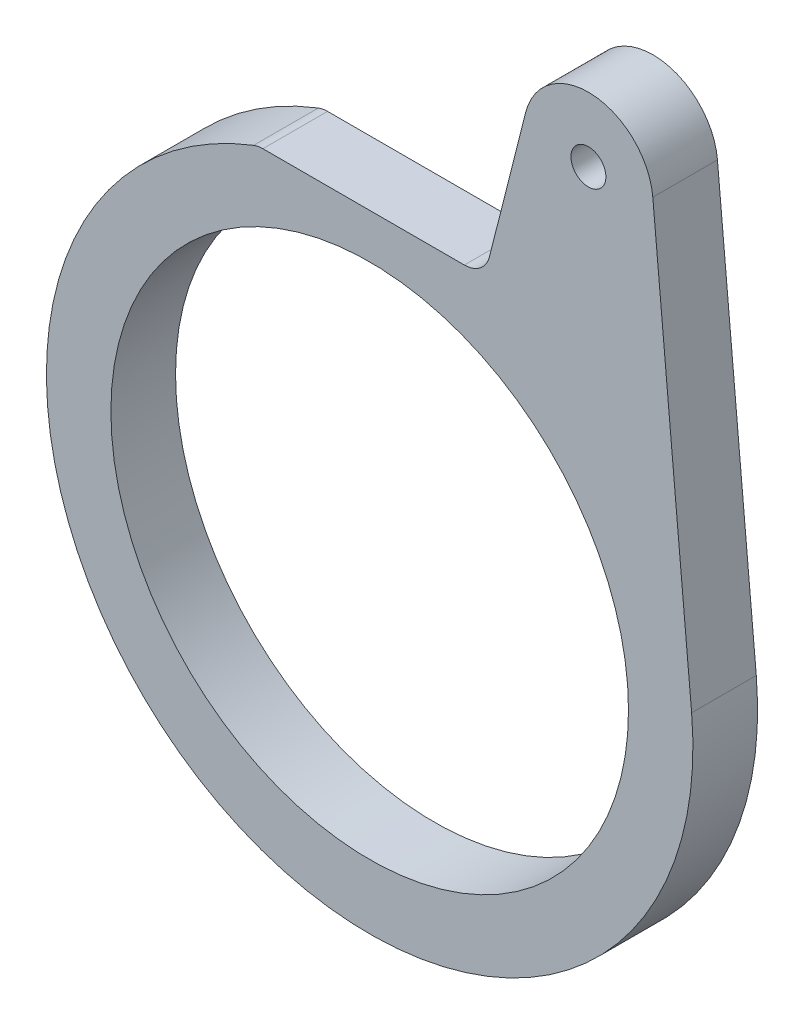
from build123d import *

# Parameters (mm, degrees)
SKETCH1_R           = 3.429
SKETCH1_R_2         = 50.8381
BOSS_EXTRUDE1_DEPTH = 6.35
FILLET1_R           = 5.08


with BuildPart() as part:
    # Sketch1 → Boss-Extrude1 (new, symmetric)
    with BuildSketch(Plane.XY):
        with BuildLine():
            Line((63.239196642, 5.749261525), (55.611939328, 89.645536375))
            ThreePointArc((55.611939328, 89.645536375), (43.96209979, 101.156410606), (30.652625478, 91.612989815))
            Line((30.652625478, 91.612989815), (22.547630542, 59.603156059))
            Line((22.547630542, 59.603156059), (-21.902369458, 59.603156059))
            ThreePointArc((-21.902369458, 59.603156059), (-33.94471696, -53.665689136), (63.239196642, 5.749261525))
        make_face()
        with Locations((42.9641, 88.49568407)):
            Circle(SKETCH1_R, mode=Mode.SUBTRACT)
        Circle(SKETCH1_R_2, mode=Mode.SUBTRACT)
    extrude(amount=BOSS_EXTRUDE1_DEPTH, both=True)

    # Fillet1
    fillet1_edges = [part.edges().sort_by_distance(p)[0] for p in [
        (-21.902369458, 59.603156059, 0),
        (22.547630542, 59.603156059, 0),
    ]]
    fillet(fillet1_edges, radius=FILLET1_R)


solid = part.part
